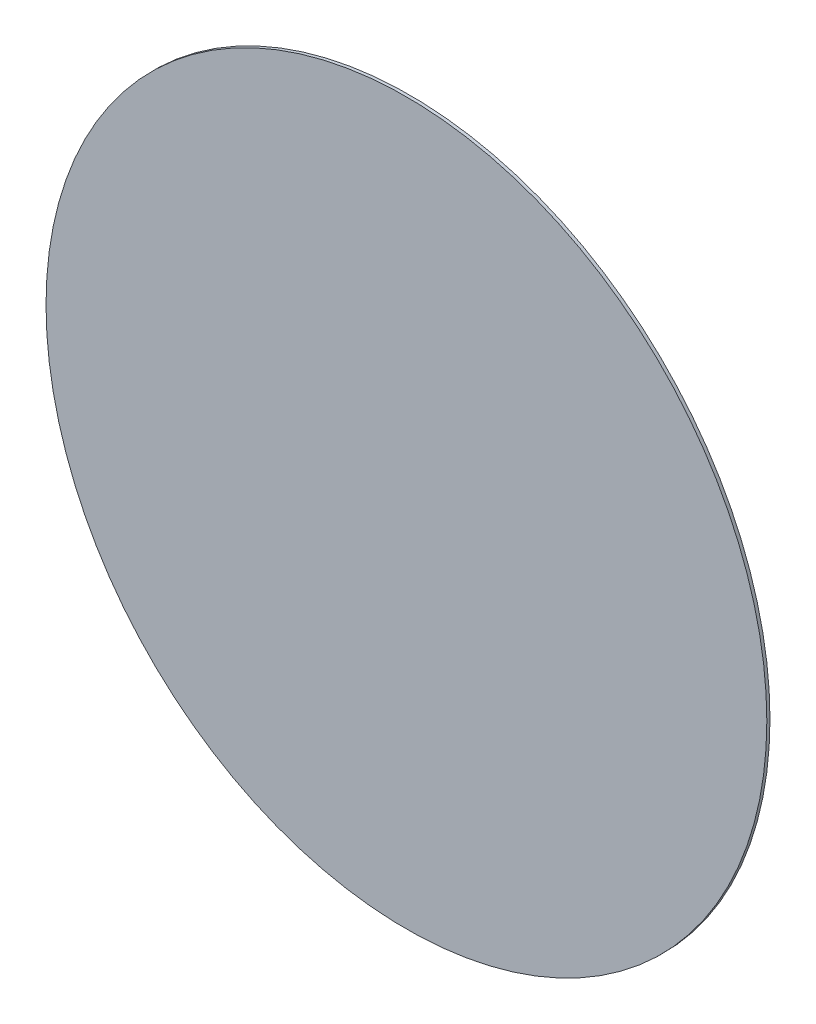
from build123d import *

# Parameters (mm, degrees)
SKETCH1_R      = 12.5
EXTRUDE1_DEPTH = 0.10922


with BuildPart() as part:
    # Sketch1 → Extrude1 (new body)
    with BuildSketch(Plane.XY):
        with Locations(Location((0, 0, 0), (0, 0, 180))):
            Circle(SKETCH1_R)
    extrude(amount=EXTRUDE1_DEPTH)


solid = part.part
